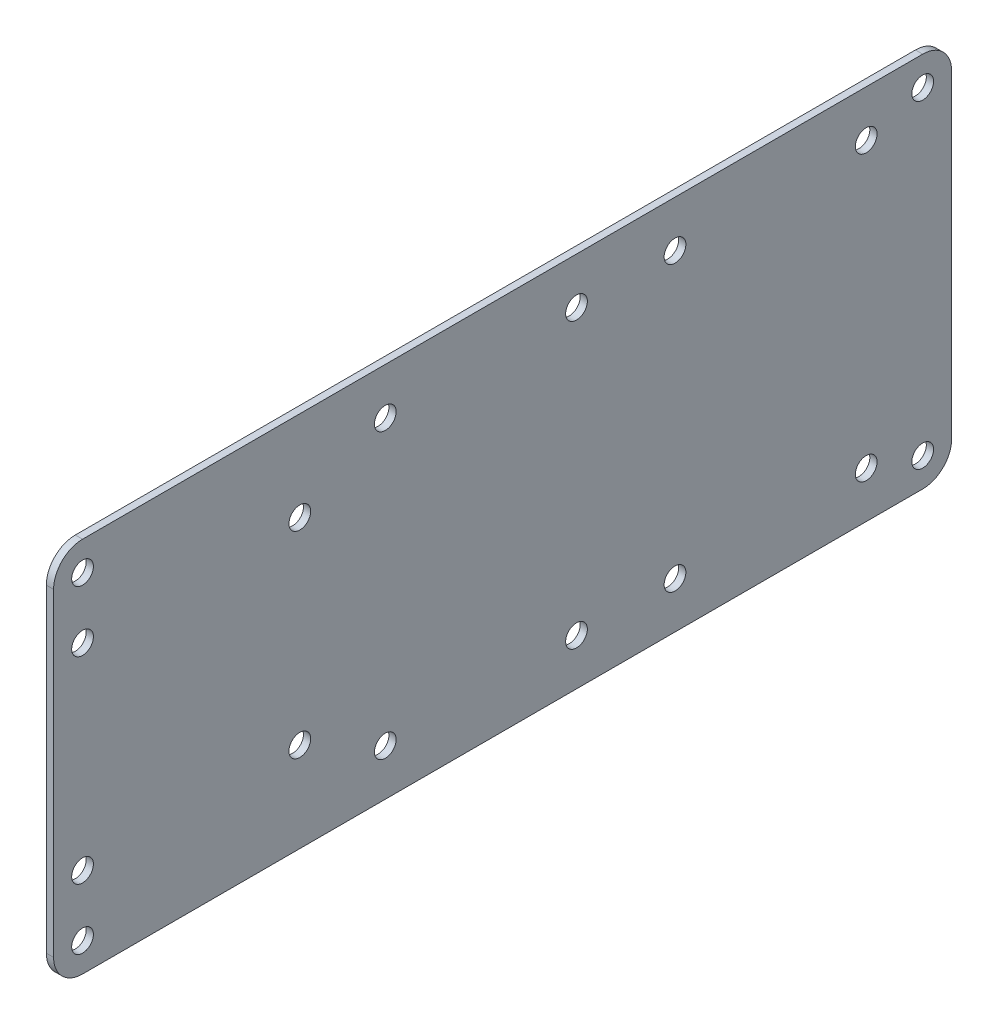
ISO-10303-21;
HEADER;
FILE_DESCRIPTION(('STEP AP214'),'2;1');
FILE_NAME('part.step','',(''),(''),'','','');
FILE_SCHEMA(('AUTOMOTIVE_DESIGN { 1 0 10303 214 1 1 1 1 }'));
ENDSEC;
DATA;
#1=APPLICATION_CONTEXT('core data for automotive mechanical design processes');
#2=APPLICATION_PROTOCOL_DEFINITION('international standard','automotive_design',2000,#1);
#3=PRODUCT_CONTEXT('',#1,'mechanical');
#4=PRODUCT('Part','Part','',(#3));
#5=PRODUCT_RELATED_PRODUCT_CATEGORY('part','',(#4));
#6=PRODUCT_DEFINITION_FORMATION('','',#4);
#7=PRODUCT_DEFINITION_CONTEXT('part definition',#1,'design');
#8=PRODUCT_DEFINITION('design','',#6,#7);
#9=PRODUCT_DEFINITION_SHAPE('','',#8);
#10=(LENGTH_UNIT() NAMED_UNIT(*) SI_UNIT(.MILLI.,.METRE.));
#11=(NAMED_UNIT(*) PLANE_ANGLE_UNIT() SI_UNIT($,.RADIAN.));
#12=(NAMED_UNIT(*) SI_UNIT($,.STERADIAN.) SOLID_ANGLE_UNIT());
#13=UNCERTAINTY_MEASURE_WITH_UNIT(LENGTH_MEASURE(1.E-05),#10,'distance_accuracy_value','');
#14=(GEOMETRIC_REPRESENTATION_CONTEXT(3) GLOBAL_UNCERTAINTY_ASSIGNED_CONTEXT((#13)) GLOBAL_UNIT_ASSIGNED_CONTEXT((#10,
#11,#12)) REPRESENTATION_CONTEXT('',''));
#15=CARTESIAN_POINT('',(0.,0.,0.));
#16=DIRECTION('',(0.,0.,1.));
#17=DIRECTION('',(1.,0.,0.));
#18=AXIS2_PLACEMENT_3D('',#15,#16,#17);
#19=CARTESIAN_POINT('',(1.5875,0.,0.));
#20=DIRECTION('',(1.,0.,0.));
#21=DIRECTION('',(0.,0.,-1.));
#22=AXIS2_PLACEMENT_3D('',#19,#20,#21);
#23=PLANE('',#22);
#24=CARTESIAN_POINT('',(1.5875,-72.39,-178.1175));
#25=DIRECTION('',(1.,0.,0.));
#26=DIRECTION('',(0.,0.,-1.));
#27=AXIS2_PLACEMENT_3D('',#24,#25,#26);
#28=CIRCLE('',#27,2.38125);
#29=CARTESIAN_POINT('',(1.5875,-72.39,-180.49875));
#30=VERTEX_POINT('',#29);
#31=EDGE_CURVE('E261',#30,#30,#28,.T.);
#32=ORIENTED_EDGE('',*,*,#31,.F.);
#33=EDGE_LOOP('',(#32));
#34=FACE_BOUND('',#33,.T.);
#35=CARTESIAN_POINT('',(1.5875,-10.16,-178.1175));
#36=DIRECTION('',(1.,0.,0.));
#37=DIRECTION('',(0.,0.,-1.));
#38=AXIS2_PLACEMENT_3D('',#35,#36,#37);
#39=CIRCLE('',#38,2.38125000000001);
#40=CARTESIAN_POINT('',(1.5875,-10.16,-180.49875));
#41=VERTEX_POINT('',#40);
#42=EDGE_CURVE('E255',#41,#41,#39,.T.);
#43=ORIENTED_EDGE('',*,*,#42,.F.);
#44=EDGE_LOOP('',(#43));
#45=FACE_BOUND('',#44,.T.);
#46=CARTESIAN_POINT('',(1.5875,-10.16,-136.2075));
#47=DIRECTION('',(1.,0.,0.));
#48=DIRECTION('',(0.,0.,-1.));
#49=AXIS2_PLACEMENT_3D('',#46,#47,#48);
#50=CIRCLE('',#49,2.38125000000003);
#51=CARTESIAN_POINT('',(1.5875,-10.16,-138.58875));
#52=VERTEX_POINT('',#51);
#53=EDGE_CURVE('E249',#52,#52,#50,.T.);
#54=ORIENTED_EDGE('',*,*,#53,.F.);
#55=EDGE_LOOP('',(#54));
#56=FACE_BOUND('',#55,.T.);
#57=CARTESIAN_POINT('',(1.5875,-72.39,-136.2075));
#58=DIRECTION('',(1.,0.,0.));
#59=DIRECTION('',(0.,0.,-1.));
#60=AXIS2_PLACEMENT_3D('',#57,#58,#59);
#61=CIRCLE('',#60,2.38125);
#62=CARTESIAN_POINT('',(1.5875,-72.39,-138.58875));
#63=VERTEX_POINT('',#62);
#64=EDGE_CURVE('E243',#63,#63,#61,.T.);
#65=ORIENTED_EDGE('',*,*,#64,.F.);
#66=EDGE_LOOP('',(#65));
#67=FACE_BOUND('',#66,.T.);
#68=CARTESIAN_POINT('',(1.5875,-72.39,-72.7075000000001));
#69=DIRECTION('',(1.,0.,0.));
#70=DIRECTION('',(0.,0.,-1.));
#71=AXIS2_PLACEMENT_3D('',#68,#69,#70);
#72=CIRCLE('',#71,2.38125);
#73=CARTESIAN_POINT('',(1.5875,-72.39,-75.08875));
#74=VERTEX_POINT('',#73);
#75=EDGE_CURVE('E237',#74,#74,#72,.T.);
#76=ORIENTED_EDGE('',*,*,#75,.F.);
#77=EDGE_LOOP('',(#76));
#78=FACE_BOUND('',#77,.T.);
#79=CARTESIAN_POINT('',(1.5875,-72.39,-114.6175));
#80=DIRECTION('',(1.,0.,0.));
#81=DIRECTION('',(0.,0.,-1.));
#82=AXIS2_PLACEMENT_3D('',#79,#80,#81);
#83=CIRCLE('',#82,2.38125);
#84=CARTESIAN_POINT('',(1.5875,-72.39,-116.99875));
#85=VERTEX_POINT('',#84);
#86=EDGE_CURVE('E231',#85,#85,#83,.T.);
#87=ORIENTED_EDGE('',*,*,#86,.F.);
#88=EDGE_LOOP('',(#87));
#89=FACE_BOUND('',#88,.T.);
#90=CARTESIAN_POINT('',(1.5875,-10.16,-114.6175));
#91=DIRECTION('',(1.,0.,0.));
#92=DIRECTION('',(0.,0.,-1.));
#93=AXIS2_PLACEMENT_3D('',#90,#91,#92);
#94=CIRCLE('',#93,2.38125000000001);
#95=CARTESIAN_POINT('',(1.5875,-10.16,-116.99875));
#96=VERTEX_POINT('',#95);
#97=EDGE_CURVE('E225',#96,#96,#94,.T.);
#98=ORIENTED_EDGE('',*,*,#97,.F.);
#99=EDGE_LOOP('',(#98));
#100=FACE_BOUND('',#99,.T.);
#101=CARTESIAN_POINT('',(1.5875,-10.16,-72.7075));
#102=DIRECTION('',(1.,0.,0.));
#103=DIRECTION('',(0.,0.,-1.));
#104=AXIS2_PLACEMENT_3D('',#101,#102,#103);
#105=CIRCLE('',#104,2.38125000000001);
#106=CARTESIAN_POINT('',(1.5875,-10.16,-75.08875));
#107=VERTEX_POINT('',#106);
#108=EDGE_CURVE('E219',#107,#107,#105,.T.);
#109=ORIENTED_EDGE('',*,*,#108,.F.);
#110=EDGE_LOOP('',(#109));
#111=FACE_BOUND('',#110,.T.);
#112=CARTESIAN_POINT('',(1.5875,-19.685,-53.975));
#113=DIRECTION('',(1.,0.,0.));
#114=DIRECTION('',(0.,0.,-1.));
#115=AXIS2_PLACEMENT_3D('',#112,#113,#114);
#116=CIRCLE('',#115,2.38125);
#117=CARTESIAN_POINT('',(1.5875,-19.685,-56.35625));
#118=VERTEX_POINT('',#117);
#119=EDGE_CURVE('E213',#118,#118,#116,.T.);
#120=ORIENTED_EDGE('',*,*,#119,.F.);
#121=EDGE_LOOP('',(#120));
#122=FACE_BOUND('',#121,.T.);
#123=CARTESIAN_POINT('',(1.5875,-62.865,-53.975));
#124=DIRECTION('',(1.,0.,0.));
#125=DIRECTION('',(0.,0.,-1.));
#126=AXIS2_PLACEMENT_3D('',#123,#124,#125);
#127=CIRCLE('',#126,2.38125);
#128=CARTESIAN_POINT('',(1.5875,-62.865,-56.35625));
#129=VERTEX_POINT('',#128);
#130=EDGE_CURVE('E207',#129,#129,#127,.T.);
#131=ORIENTED_EDGE('',*,*,#130,.F.);
#132=EDGE_LOOP('',(#131));
#133=FACE_BOUND('',#132,.T.);
#134=CARTESIAN_POINT('',(1.5875,-62.865,-6.35000000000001));
#135=DIRECTION('',(1.,0.,0.));
#136=DIRECTION('',(0.,0.,-1.));
#137=AXIS2_PLACEMENT_3D('',#134,#135,#136);
#138=CIRCLE('',#137,2.38125000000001);
#139=CARTESIAN_POINT('',(1.5875,-62.865,-8.73125000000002));
#140=VERTEX_POINT('',#139);
#141=EDGE_CURVE('E201',#140,#140,#138,.T.);
#142=ORIENTED_EDGE('',*,*,#141,.F.);
#143=EDGE_LOOP('',(#142));
#144=FACE_BOUND('',#143,.T.);
#145=CARTESIAN_POINT('',(1.5875,-19.685,-6.35));
#146=DIRECTION('',(1.,0.,0.));
#147=DIRECTION('',(0.,0.,-1.));
#148=AXIS2_PLACEMENT_3D('',#145,#146,#147);
#149=CIRCLE('',#148,2.38125);
#150=CARTESIAN_POINT('',(1.5875,-19.685,-8.73125000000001));
#151=VERTEX_POINT('',#150);
#152=EDGE_CURVE('E195',#151,#151,#149,.T.);
#153=ORIENTED_EDGE('',*,*,#152,.F.);
#154=EDGE_LOOP('',(#153));
#155=FACE_BOUND('',#154,.T.);
#156=CARTESIAN_POINT('',(1.5875,-76.2,-190.5));
#157=DIRECTION('',(1.,0.,0.));
#158=DIRECTION('',(0.,0.,-1.));
#159=AXIS2_PLACEMENT_3D('',#156,#157,#158);
#160=CIRCLE('',#159,2.38125);
#161=CARTESIAN_POINT('',(1.5875,-76.2,-192.88125));
#162=VERTEX_POINT('',#161);
#163=EDGE_CURVE('E180',#162,#162,#160,.T.);
#164=ORIENTED_EDGE('',*,*,#163,.F.);
#165=EDGE_LOOP('',(#164));
#166=FACE_BOUND('',#165,.T.);
#167=CARTESIAN_POINT('',(1.5875,-6.35,-6.35));
#168=DIRECTION('',(1.,0.,0.));
#169=DIRECTION('',(0.,0.,-1.));
#170=AXIS2_PLACEMENT_3D('',#167,#168,#169);
#171=CIRCLE('',#170,2.38125);
#172=CARTESIAN_POINT('',(1.5875,-6.35,-8.73125));
#173=VERTEX_POINT('',#172);
#174=EDGE_CURVE('E163',#173,#173,#171,.T.);
#175=ORIENTED_EDGE('',*,*,#174,.F.);
#176=EDGE_LOOP('',(#175));
#177=FACE_BOUND('',#176,.T.);
#178=DIRECTION('',(0.,1.,0.));
#179=VECTOR('',#178,1.);
#180=CARTESIAN_POINT('',(1.5875,0.,-196.85));
#181=LINE('',#180,#179);
#182=CARTESIAN_POINT('',(1.5875,-76.2,-196.85));
#183=VERTEX_POINT('',#182);
#184=CARTESIAN_POINT('',(1.5875,-6.35,-196.85));
#185=VERTEX_POINT('',#184);
#186=EDGE_CURVE('E170',#183,#185,#181,.T.);
#187=ORIENTED_EDGE('',*,*,#186,.T.);
#188=CARTESIAN_POINT('',(1.5875,-6.35,-190.5));
#189=DIRECTION('',(1.,0.,0.));
#190=DIRECTION('',(0.,0.,-1.));
#191=AXIS2_PLACEMENT_3D('',#188,#189,#190);
#192=CIRCLE('',#191,6.35);
#193=CARTESIAN_POINT('',(1.5875,0.,-190.5));
#194=VERTEX_POINT('',#193);
#195=EDGE_CURVE('E147',#185,#194,#192,.T.);
#196=ORIENTED_EDGE('',*,*,#195,.T.);
#197=DIRECTION('',(0.,0.,1.));
#198=VECTOR('',#197,1.);
#199=CARTESIAN_POINT('',(1.5875,0.,0.));
#200=LINE('',#199,#198);
#201=CARTESIAN_POINT('',(1.5875,0.,-6.35));
#202=VERTEX_POINT('',#201);
#203=EDGE_CURVE('E118',#194,#202,#200,.T.);
#204=ORIENTED_EDGE('',*,*,#203,.T.);
#205=CARTESIAN_POINT('',(1.5875,-6.35,-6.35));
#206=DIRECTION('',(1.,0.,0.));
#207=DIRECTION('',(0.,0.,-1.));
#208=AXIS2_PLACEMENT_3D('',#205,#206,#207);
#209=CIRCLE('',#208,6.35);
#210=CARTESIAN_POINT('',(1.5875,-6.35,0.));
#211=VERTEX_POINT('',#210);
#212=EDGE_CURVE('E142',#202,#211,#209,.T.);
#213=ORIENTED_EDGE('',*,*,#212,.T.);
#214=DIRECTION('',(0.,-1.,0.));
#215=VECTOR('',#214,1.);
#216=CARTESIAN_POINT('',(1.5875,0.,0.));
#217=LINE('',#216,#215);
#218=CARTESIAN_POINT('',(1.5875,-76.2,0.));
#219=VERTEX_POINT('',#218);
#220=EDGE_CURVE('E125',#211,#219,#217,.T.);
#221=ORIENTED_EDGE('',*,*,#220,.T.);
#222=CARTESIAN_POINT('',(1.5875,-76.2,-6.35000000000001));
#223=DIRECTION('',(1.,0.,0.));
#224=DIRECTION('',(0.,0.,-1.));
#225=AXIS2_PLACEMENT_3D('',#222,#223,#224);
#226=CIRCLE('',#225,6.35);
#227=CARTESIAN_POINT('',(1.5875,-82.55,-6.35000000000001));
#228=VERTEX_POINT('',#227);
#229=EDGE_CURVE('E54',#219,#228,#226,.T.);
#230=ORIENTED_EDGE('',*,*,#229,.T.);
#231=DIRECTION('',(0.,0.,-1.));
#232=VECTOR('',#231,1.);
#233=CARTESIAN_POINT('',(1.5875,-82.55,0.));
#234=LINE('',#233,#232);
#235=CARTESIAN_POINT('',(1.5875,-82.55,-190.5));
#236=VERTEX_POINT('',#235);
#237=EDGE_CURVE('E128',#228,#236,#234,.T.);
#238=ORIENTED_EDGE('',*,*,#237,.T.);
#239=CARTESIAN_POINT('',(1.5875,-76.2,-190.5));
#240=DIRECTION('',(1.,0.,0.));
#241=DIRECTION('',(0.,0.,-1.));
#242=AXIS2_PLACEMENT_3D('',#239,#240,#241);
#243=CIRCLE('',#242,6.35);
#244=EDGE_CURVE('E145',#236,#183,#243,.T.);
#245=ORIENTED_EDGE('',*,*,#244,.T.);
#246=EDGE_LOOP('',(#187,#196,#204,#213,#221,#230,#238,#245));
#247=FACE_BOUND('',#246,.T.);
#248=CARTESIAN_POINT('',(1.5875,-76.2,-6.35000000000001));
#249=DIRECTION('',(1.,0.,0.));
#250=DIRECTION('',(0.,0.,-1.));
#251=AXIS2_PLACEMENT_3D('',#248,#249,#250);
#252=CIRCLE('',#251,2.38125);
#253=CARTESIAN_POINT('',(1.5875,-76.2,-8.73125000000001));
#254=VERTEX_POINT('',#253);
#255=EDGE_CURVE('E175',#254,#254,#252,.T.);
#256=ORIENTED_EDGE('',*,*,#255,.F.);
#257=EDGE_LOOP('',(#256));
#258=FACE_BOUND('',#257,.T.);
#259=CARTESIAN_POINT('',(1.5875,-6.35,-190.5));
#260=DIRECTION('',(1.,0.,0.));
#261=DIRECTION('',(0.,0.,-1.));
#262=AXIS2_PLACEMENT_3D('',#259,#260,#261);
#263=CIRCLE('',#262,2.38125000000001);
#264=CARTESIAN_POINT('',(1.5875,-6.35,-192.88125));
#265=VERTEX_POINT('',#264);
#266=EDGE_CURVE('E186',#265,#265,#263,.T.);
#267=ORIENTED_EDGE('',*,*,#266,.F.);
#268=EDGE_LOOP('',(#267));
#269=FACE_BOUND('',#268,.T.);
#270=ADVANCED_FACE('F32',(#34,#45,#56,#67,#78,#89,#100,#111,#122,#133,#144,#155,#166,#177,#247,
#258,#269),#23,.T.);
#271=CARTESIAN_POINT('',(0.,0.,0.));
#272=DIRECTION('',(1.,0.,0.));
#273=DIRECTION('',(0.,0.,-1.));
#274=AXIS2_PLACEMENT_3D('',#271,#272,#273);
#275=PLANE('',#274);
#276=CARTESIAN_POINT('',(0.,-72.39,-178.1175));
#277=DIRECTION('',(1.,0.,0.));
#278=DIRECTION('',(0.,0.,-1.));
#279=AXIS2_PLACEMENT_3D('',#276,#277,#278);
#280=CIRCLE('',#279,2.38125);
#281=CARTESIAN_POINT('',(0.,-72.39,-180.49875));
#282=VERTEX_POINT('',#281);
#283=EDGE_CURVE('E258',#282,#282,#280,.T.);
#284=ORIENTED_EDGE('',*,*,#283,.T.);
#285=EDGE_LOOP('',(#284));
#286=FACE_BOUND('',#285,.T.);
#287=CARTESIAN_POINT('',(0.,-10.16,-178.1175));
#288=DIRECTION('',(1.,0.,0.));
#289=DIRECTION('',(0.,0.,-1.));
#290=AXIS2_PLACEMENT_3D('',#287,#288,#289);
#291=CIRCLE('',#290,2.38125000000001);
#292=CARTESIAN_POINT('',(0.,-10.16,-180.49875));
#293=VERTEX_POINT('',#292);
#294=EDGE_CURVE('E252',#293,#293,#291,.T.);
#295=ORIENTED_EDGE('',*,*,#294,.T.);
#296=EDGE_LOOP('',(#295));
#297=FACE_BOUND('',#296,.T.);
#298=CARTESIAN_POINT('',(0.,-10.16,-136.2075));
#299=DIRECTION('',(1.,0.,0.));
#300=DIRECTION('',(0.,0.,-1.));
#301=AXIS2_PLACEMENT_3D('',#298,#299,#300);
#302=CIRCLE('',#301,2.38125000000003);
#303=CARTESIAN_POINT('',(0.,-10.16,-138.58875));
#304=VERTEX_POINT('',#303);
#305=EDGE_CURVE('E246',#304,#304,#302,.T.);
#306=ORIENTED_EDGE('',*,*,#305,.T.);
#307=EDGE_LOOP('',(#306));
#308=FACE_BOUND('',#307,.T.);
#309=CARTESIAN_POINT('',(0.,-72.39,-136.2075));
#310=DIRECTION('',(1.,0.,0.));
#311=DIRECTION('',(0.,0.,-1.));
#312=AXIS2_PLACEMENT_3D('',#309,#310,#311);
#313=CIRCLE('',#312,2.38125);
#314=CARTESIAN_POINT('',(0.,-72.39,-138.58875));
#315=VERTEX_POINT('',#314);
#316=EDGE_CURVE('E240',#315,#315,#313,.T.);
#317=ORIENTED_EDGE('',*,*,#316,.T.);
#318=EDGE_LOOP('',(#317));
#319=FACE_BOUND('',#318,.T.);
#320=CARTESIAN_POINT('',(0.,-72.39,-72.7075000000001));
#321=DIRECTION('',(1.,0.,0.));
#322=DIRECTION('',(0.,0.,-1.));
#323=AXIS2_PLACEMENT_3D('',#320,#321,#322);
#324=CIRCLE('',#323,2.38125);
#325=CARTESIAN_POINT('',(0.,-72.39,-75.08875));
#326=VERTEX_POINT('',#325);
#327=EDGE_CURVE('E234',#326,#326,#324,.T.);
#328=ORIENTED_EDGE('',*,*,#327,.T.);
#329=EDGE_LOOP('',(#328));
#330=FACE_BOUND('',#329,.T.);
#331=CARTESIAN_POINT('',(0.,-72.39,-114.6175));
#332=DIRECTION('',(1.,0.,0.));
#333=DIRECTION('',(0.,0.,-1.));
#334=AXIS2_PLACEMENT_3D('',#331,#332,#333);
#335=CIRCLE('',#334,2.38125);
#336=CARTESIAN_POINT('',(0.,-72.39,-116.99875));
#337=VERTEX_POINT('',#336);
#338=EDGE_CURVE('E228',#337,#337,#335,.T.);
#339=ORIENTED_EDGE('',*,*,#338,.T.);
#340=EDGE_LOOP('',(#339));
#341=FACE_BOUND('',#340,.T.);
#342=CARTESIAN_POINT('',(0.,-10.16,-114.6175));
#343=DIRECTION('',(1.,0.,0.));
#344=DIRECTION('',(0.,0.,-1.));
#345=AXIS2_PLACEMENT_3D('',#342,#343,#344);
#346=CIRCLE('',#345,2.38125000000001);
#347=CARTESIAN_POINT('',(0.,-10.16,-116.99875));
#348=VERTEX_POINT('',#347);
#349=EDGE_CURVE('E222',#348,#348,#346,.T.);
#350=ORIENTED_EDGE('',*,*,#349,.T.);
#351=EDGE_LOOP('',(#350));
#352=FACE_BOUND('',#351,.T.);
#353=CARTESIAN_POINT('',(0.,-10.16,-72.7075));
#354=DIRECTION('',(1.,0.,0.));
#355=DIRECTION('',(0.,0.,-1.));
#356=AXIS2_PLACEMENT_3D('',#353,#354,#355);
#357=CIRCLE('',#356,2.38125000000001);
#358=CARTESIAN_POINT('',(0.,-10.16,-75.08875));
#359=VERTEX_POINT('',#358);
#360=EDGE_CURVE('E216',#359,#359,#357,.T.);
#361=ORIENTED_EDGE('',*,*,#360,.T.);
#362=EDGE_LOOP('',(#361));
#363=FACE_BOUND('',#362,.T.);
#364=CARTESIAN_POINT('',(0.,-19.685,-53.975));
#365=DIRECTION('',(1.,0.,0.));
#366=DIRECTION('',(0.,0.,-1.));
#367=AXIS2_PLACEMENT_3D('',#364,#365,#366);
#368=CIRCLE('',#367,2.38125);
#369=CARTESIAN_POINT('',(0.,-19.685,-56.35625));
#370=VERTEX_POINT('',#369);
#371=EDGE_CURVE('E210',#370,#370,#368,.T.);
#372=ORIENTED_EDGE('',*,*,#371,.T.);
#373=EDGE_LOOP('',(#372));
#374=FACE_BOUND('',#373,.T.);
#375=CARTESIAN_POINT('',(0.,-62.865,-53.975));
#376=DIRECTION('',(1.,0.,0.));
#377=DIRECTION('',(0.,0.,-1.));
#378=AXIS2_PLACEMENT_3D('',#375,#376,#377);
#379=CIRCLE('',#378,2.38125);
#380=CARTESIAN_POINT('',(0.,-62.865,-56.35625));
#381=VERTEX_POINT('',#380);
#382=EDGE_CURVE('E204',#381,#381,#379,.T.);
#383=ORIENTED_EDGE('',*,*,#382,.T.);
#384=EDGE_LOOP('',(#383));
#385=FACE_BOUND('',#384,.T.);
#386=CARTESIAN_POINT('',(0.,-62.865,-6.35000000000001));
#387=DIRECTION('',(1.,0.,0.));
#388=DIRECTION('',(0.,0.,-1.));
#389=AXIS2_PLACEMENT_3D('',#386,#387,#388);
#390=CIRCLE('',#389,2.38125000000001);
#391=CARTESIAN_POINT('',(0.,-62.865,-8.73125000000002));
#392=VERTEX_POINT('',#391);
#393=EDGE_CURVE('E198',#392,#392,#390,.T.);
#394=ORIENTED_EDGE('',*,*,#393,.T.);
#395=EDGE_LOOP('',(#394));
#396=FACE_BOUND('',#395,.T.);
#397=CARTESIAN_POINT('',(0.,-19.685,-6.35));
#398=DIRECTION('',(1.,0.,0.));
#399=DIRECTION('',(0.,0.,-1.));
#400=AXIS2_PLACEMENT_3D('',#397,#398,#399);
#401=CIRCLE('',#400,2.38125);
#402=CARTESIAN_POINT('',(0.,-19.685,-8.73125000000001));
#403=VERTEX_POINT('',#402);
#404=EDGE_CURVE('E192',#403,#403,#401,.T.);
#405=ORIENTED_EDGE('',*,*,#404,.T.);
#406=EDGE_LOOP('',(#405));
#407=FACE_BOUND('',#406,.T.);
#408=DIRECTION('',(0.,0.,1.));
#409=VECTOR('',#408,1.);
#410=CARTESIAN_POINT('',(0.,0.,0.));
#411=LINE('',#410,#409);
#412=CARTESIAN_POINT('',(0.,0.,-190.5));
#413=VERTEX_POINT('',#412);
#414=CARTESIAN_POINT('',(0.,0.,-6.35));
#415=VERTEX_POINT('',#414);
#416=EDGE_CURVE('E115',#413,#415,#411,.T.);
#417=ORIENTED_EDGE('',*,*,#416,.F.);
#418=CARTESIAN_POINT('',(0.,-6.35,-190.5));
#419=DIRECTION('',(1.,0.,0.));
#420=DIRECTION('',(0.,0.,-1.));
#421=AXIS2_PLACEMENT_3D('',#418,#419,#420);
#422=CIRCLE('',#421,6.35);
#423=CARTESIAN_POINT('',(0.,-6.35,-196.85));
#424=VERTEX_POINT('',#423);
#425=EDGE_CURVE('E98',#413,#424,#422,.F.);
#426=ORIENTED_EDGE('',*,*,#425,.T.);
#427=DIRECTION('',(0.,1.,0.));
#428=VECTOR('',#427,1.);
#429=CARTESIAN_POINT('',(0.,0.,-196.85));
#430=LINE('',#429,#428);
#431=CARTESIAN_POINT('',(0.,-76.2,-196.85));
#432=VERTEX_POINT('',#431);
#433=EDGE_CURVE('E126',#432,#424,#430,.T.);
#434=ORIENTED_EDGE('',*,*,#433,.F.);
#435=CARTESIAN_POINT('',(0.,-76.2,-190.5));
#436=DIRECTION('',(1.,0.,0.));
#437=DIRECTION('',(0.,0.,-1.));
#438=AXIS2_PLACEMENT_3D('',#435,#436,#437);
#439=CIRCLE('',#438,6.35);
#440=CARTESIAN_POINT('',(0.,-82.55,-190.5));
#441=VERTEX_POINT('',#440);
#442=EDGE_CURVE('E109',#432,#441,#439,.F.);
#443=ORIENTED_EDGE('',*,*,#442,.T.);
#444=DIRECTION('',(0.,0.,-1.));
#445=VECTOR('',#444,1.);
#446=CARTESIAN_POINT('',(0.,-82.55,0.));
#447=LINE('',#446,#445);
#448=CARTESIAN_POINT('',(0.,-82.55,-6.35000000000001));
#449=VERTEX_POINT('',#448);
#450=EDGE_CURVE('E130',#449,#441,#447,.T.);
#451=ORIENTED_EDGE('',*,*,#450,.F.);
#452=CARTESIAN_POINT('',(0.,-76.2,-6.35000000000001));
#453=DIRECTION('',(1.,0.,0.));
#454=DIRECTION('',(0.,0.,-1.));
#455=AXIS2_PLACEMENT_3D('',#452,#453,#454);
#456=CIRCLE('',#455,6.35);
#457=CARTESIAN_POINT('',(0.,-76.2,0.));
#458=VERTEX_POINT('',#457);
#459=EDGE_CURVE('E136',#449,#458,#456,.F.);
#460=ORIENTED_EDGE('',*,*,#459,.T.);
#461=DIRECTION('',(0.,-1.,0.));
#462=VECTOR('',#461,1.);
#463=CARTESIAN_POINT('',(0.,0.,0.));
#464=LINE('',#463,#462);
#465=CARTESIAN_POINT('',(0.,-6.35,0.));
#466=VERTEX_POINT('',#465);
#467=EDGE_CURVE('E158',#466,#458,#464,.T.);
#468=ORIENTED_EDGE('',*,*,#467,.F.);
#469=CARTESIAN_POINT('',(0.,-6.35,-6.35));
#470=DIRECTION('',(1.,0.,0.));
#471=DIRECTION('',(0.,0.,-1.));
#472=AXIS2_PLACEMENT_3D('',#469,#470,#471);
#473=CIRCLE('',#472,6.35);
#474=EDGE_CURVE('E119',#466,#415,#473,.F.);
#475=ORIENTED_EDGE('',*,*,#474,.T.);
#476=EDGE_LOOP('',(#417,#426,#434,#443,#451,#460,#468,#475));
#477=FACE_BOUND('',#476,.T.);
#478=CARTESIAN_POINT('',(0.,-6.35,-6.35));
#479=DIRECTION('',(1.,0.,0.));
#480=DIRECTION('',(0.,0.,-1.));
#481=AXIS2_PLACEMENT_3D('',#478,#479,#480);
#482=CIRCLE('',#481,2.38125);
#483=CARTESIAN_POINT('',(0.,-6.35,-8.73125));
#484=VERTEX_POINT('',#483);
#485=EDGE_CURVE('E166',#484,#484,#482,.T.);
#486=ORIENTED_EDGE('',*,*,#485,.T.);
#487=EDGE_LOOP('',(#486));
#488=FACE_BOUND('',#487,.T.);
#489=CARTESIAN_POINT('',(0.,-76.2,-6.35000000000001));
#490=DIRECTION('',(1.,0.,0.));
#491=DIRECTION('',(0.,0.,-1.));
#492=AXIS2_PLACEMENT_3D('',#489,#490,#491);
#493=CIRCLE('',#492,2.38125);
#494=CARTESIAN_POINT('',(0.,-76.2,-8.73125000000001));
#495=VERTEX_POINT('',#494);
#496=EDGE_CURVE('E177',#495,#495,#493,.T.);
#497=ORIENTED_EDGE('',*,*,#496,.T.);
#498=EDGE_LOOP('',(#497));
#499=FACE_BOUND('',#498,.T.);
#500=CARTESIAN_POINT('',(0.,-76.2,-190.5));
#501=DIRECTION('',(1.,0.,0.));
#502=DIRECTION('',(0.,0.,-1.));
#503=AXIS2_PLACEMENT_3D('',#500,#501,#502);
#504=CIRCLE('',#503,2.38125);
#505=CARTESIAN_POINT('',(0.,-76.2,-192.88125));
#506=VERTEX_POINT('',#505);
#507=EDGE_CURVE('E183',#506,#506,#504,.T.);
#508=ORIENTED_EDGE('',*,*,#507,.T.);
#509=EDGE_LOOP('',(#508));
#510=FACE_BOUND('',#509,.T.);
#511=CARTESIAN_POINT('',(0.,-6.35,-190.5));
#512=DIRECTION('',(1.,0.,0.));
#513=DIRECTION('',(0.,0.,-1.));
#514=AXIS2_PLACEMENT_3D('',#511,#512,#513);
#515=CIRCLE('',#514,2.38125000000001);
#516=CARTESIAN_POINT('',(0.,-6.35,-192.88125));
#517=VERTEX_POINT('',#516);
#518=EDGE_CURVE('E189',#517,#517,#515,.T.);
#519=ORIENTED_EDGE('',*,*,#518,.T.);
#520=EDGE_LOOP('',(#519));
#521=FACE_BOUND('',#520,.T.);
#522=ADVANCED_FACE('F122',(#286,#297,#308,#319,#330,#341,#352,#363,#374,#385,#396,#407,#477,
#488,#499,#510,#521),#275,.F.);
#523=CARTESIAN_POINT('',(1.5875,0.,0.));
#524=DIRECTION('',(0.,0.,-1.));
#525=DIRECTION('',(0.,1.,0.));
#526=AXIS2_PLACEMENT_3D('',#523,#524,#525);
#527=PLANE('',#526);
#528=ORIENTED_EDGE('',*,*,#467,.T.);
#529=DIRECTION('',(-1.,0.,0.));
#530=VECTOR('',#529,1.);
#531=CARTESIAN_POINT('',(1.5875,-76.2,0.));
#532=LINE('',#531,#530);
#533=EDGE_CURVE('E11',#458,#219,#532,.F.);
#534=ORIENTED_EDGE('',*,*,#533,.T.);
#535=ORIENTED_EDGE('',*,*,#220,.F.);
#536=DIRECTION('',(-1.,0.,0.));
#537=VECTOR('',#536,1.);
#538=CARTESIAN_POINT('',(1.5875,-6.35,0.));
#539=LINE('',#538,#537);
#540=EDGE_CURVE('E40',#211,#466,#539,.T.);
#541=ORIENTED_EDGE('',*,*,#540,.T.);
#542=EDGE_LOOP('',(#528,#534,#535,#541));
#543=FACE_BOUND('',#542,.T.);
#544=ADVANCED_FACE('F157',(#543),#527,.F.);
#545=CARTESIAN_POINT('',(1.5875,-82.55,0.));
#546=DIRECTION('',(0.,1.,0.));
#547=DIRECTION('',(0.,0.,1.));
#548=AXIS2_PLACEMENT_3D('',#545,#546,#547);
#549=PLANE('',#548);
#550=ORIENTED_EDGE('',*,*,#450,.T.);
#551=DIRECTION('',(-1.,0.,0.));
#552=VECTOR('',#551,1.);
#553=CARTESIAN_POINT('',(1.5875,-82.55,-190.5));
#554=LINE('',#553,#552);
#555=EDGE_CURVE('E47',#441,#236,#554,.F.);
#556=ORIENTED_EDGE('',*,*,#555,.T.);
#557=ORIENTED_EDGE('',*,*,#237,.F.);
#558=DIRECTION('',(-1.,0.,0.));
#559=VECTOR('',#558,1.);
#560=CARTESIAN_POINT('',(1.5875,-82.55,-6.35000000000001));
#561=LINE('',#560,#559);
#562=EDGE_CURVE('E149',#228,#449,#561,.T.);
#563=ORIENTED_EDGE('',*,*,#562,.T.);
#564=EDGE_LOOP('',(#550,#556,#557,#563));
#565=FACE_BOUND('',#564,.T.);
#566=ADVANCED_FACE('F323',(#565),#549,.F.);
#567=CARTESIAN_POINT('',(1.5875,0.,-196.85));
#568=DIRECTION('',(0.,0.,1.));
#569=DIRECTION('',(1.,0.,0.));
#570=AXIS2_PLACEMENT_3D('',#567,#568,#569);
#571=PLANE('',#570);
#572=ORIENTED_EDGE('',*,*,#433,.T.);
#573=DIRECTION('',(-1.,0.,0.));
#574=VECTOR('',#573,1.);
#575=CARTESIAN_POINT('',(1.5875,-6.35,-196.85));
#576=LINE('',#575,#574);
#577=EDGE_CURVE('E103',#424,#185,#576,.F.);
#578=ORIENTED_EDGE('',*,*,#577,.T.);
#579=ORIENTED_EDGE('',*,*,#186,.F.);
#580=DIRECTION('',(-1.,0.,0.));
#581=VECTOR('',#580,1.);
#582=CARTESIAN_POINT('',(1.5875,-76.2,-196.85));
#583=LINE('',#582,#581);
#584=EDGE_CURVE('E108',#183,#432,#583,.T.);
#585=ORIENTED_EDGE('',*,*,#584,.T.);
#586=EDGE_LOOP('',(#572,#578,#579,#585));
#587=FACE_BOUND('',#586,.T.);
#588=ADVANCED_FACE('F330',(#587),#571,.F.);
#589=CARTESIAN_POINT('',(1.5875,0.,0.));
#590=DIRECTION('',(0.,-1.,0.));
#591=DIRECTION('',(0.,0.,-1.));
#592=AXIS2_PLACEMENT_3D('',#589,#590,#591);
#593=PLANE('',#592);
#594=ORIENTED_EDGE('',*,*,#203,.F.);
#595=DIRECTION('',(-1.,0.,0.));
#596=VECTOR('',#595,1.);
#597=CARTESIAN_POINT('',(1.5875,0.,-190.5));
#598=LINE('',#597,#596);
#599=EDGE_CURVE('E102',#194,#413,#598,.T.);
#600=ORIENTED_EDGE('',*,*,#599,.T.);
#601=ORIENTED_EDGE('',*,*,#416,.T.);
#602=DIRECTION('',(-1.,0.,0.));
#603=VECTOR('',#602,1.);
#604=CARTESIAN_POINT('',(1.5875,0.,-6.35));
#605=LINE('',#604,#603);
#606=EDGE_CURVE('E120',#415,#202,#605,.F.);
#607=ORIENTED_EDGE('',*,*,#606,.T.);
#608=EDGE_LOOP('',(#594,#600,#601,#607));
#609=FACE_BOUND('',#608,.T.);
#610=ADVANCED_FACE('F114',(#609),#593,.F.);
#611=CARTESIAN_POINT('',(1.5875,-6.35,-6.35));
#612=DIRECTION('',(-1.,0.,0.));
#613=DIRECTION('',(0.,0.,1.));
#614=AXIS2_PLACEMENT_3D('',#611,#612,#613);
#615=CYLINDRICAL_SURFACE('',#614,2.38125);
#616=ORIENTED_EDGE('',*,*,#174,.T.);
#617=EDGE_LOOP('',(#616));
#618=FACE_BOUND('',#617,.T.);
#619=ORIENTED_EDGE('',*,*,#485,.F.);
#620=EDGE_LOOP('',(#619));
#621=FACE_BOUND('',#620,.T.);
#622=ADVANCED_FACE('F329',(#618,#621),#615,.F.);
#623=CARTESIAN_POINT('',(1.5875,-76.2,-6.35000000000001));
#624=DIRECTION('',(-1.,0.,0.));
#625=DIRECTION('',(0.,0.,1.));
#626=AXIS2_PLACEMENT_3D('',#623,#624,#625);
#627=CYLINDRICAL_SURFACE('',#626,2.38125);
#628=ORIENTED_EDGE('',*,*,#255,.T.);
#629=EDGE_LOOP('',(#628));
#630=FACE_BOUND('',#629,.T.);
#631=ORIENTED_EDGE('',*,*,#496,.F.);
#632=EDGE_LOOP('',(#631));
#633=FACE_BOUND('',#632,.T.);
#634=ADVANCED_FACE('F533',(#630,#633),#627,.F.);
#635=CARTESIAN_POINT('',(1.5875,-76.2,-190.5));
#636=DIRECTION('',(-1.,0.,0.));
#637=DIRECTION('',(0.,0.,1.));
#638=AXIS2_PLACEMENT_3D('',#635,#636,#637);
#639=CYLINDRICAL_SURFACE('',#638,2.38125);
#640=ORIENTED_EDGE('',*,*,#163,.T.);
#641=EDGE_LOOP('',(#640));
#642=FACE_BOUND('',#641,.T.);
#643=ORIENTED_EDGE('',*,*,#507,.F.);
#644=EDGE_LOOP('',(#643));
#645=FACE_BOUND('',#644,.T.);
#646=ADVANCED_FACE('F314',(#642,#645),#639,.F.);
#647=CARTESIAN_POINT('',(1.5875,-6.35,-190.5));
#648=DIRECTION('',(-1.,0.,0.));
#649=DIRECTION('',(0.,0.,1.));
#650=AXIS2_PLACEMENT_3D('',#647,#648,#649);
#651=CYLINDRICAL_SURFACE('',#650,2.38125000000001);
#652=ORIENTED_EDGE('',*,*,#266,.T.);
#653=EDGE_LOOP('',(#652));
#654=FACE_BOUND('',#653,.T.);
#655=ORIENTED_EDGE('',*,*,#518,.F.);
#656=EDGE_LOOP('',(#655));
#657=FACE_BOUND('',#656,.T.);
#658=ADVANCED_FACE('F310',(#654,#657),#651,.F.);
#659=CARTESIAN_POINT('',(0.,-19.685,-6.35));
#660=DIRECTION('',(1.,0.,0.));
#661=DIRECTION('',(0.,0.,-1.));
#662=AXIS2_PLACEMENT_3D('',#659,#660,#661);
#663=CYLINDRICAL_SURFACE('',#662,2.38125);
#664=ORIENTED_EDGE('',*,*,#404,.F.);
#665=EDGE_LOOP('',(#664));
#666=FACE_BOUND('',#665,.T.);
#667=ORIENTED_EDGE('',*,*,#152,.T.);
#668=EDGE_LOOP('',(#667));
#669=FACE_BOUND('',#668,.T.);
#670=ADVANCED_FACE('F313',(#666,#669),#663,.F.);
#671=CARTESIAN_POINT('',(0.,-62.865,-6.35000000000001));
#672=DIRECTION('',(1.,0.,0.));
#673=DIRECTION('',(0.,0.,-1.));
#674=AXIS2_PLACEMENT_3D('',#671,#672,#673);
#675=CYLINDRICAL_SURFACE('',#674,2.38125000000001);
#676=ORIENTED_EDGE('',*,*,#393,.F.);
#677=EDGE_LOOP('',(#676));
#678=FACE_BOUND('',#677,.T.);
#679=ORIENTED_EDGE('',*,*,#141,.T.);
#680=EDGE_LOOP('',(#679));
#681=FACE_BOUND('',#680,.T.);
#682=ADVANCED_FACE('F499',(#678,#681),#675,.F.);
#683=CARTESIAN_POINT('',(0.,-62.865,-53.975));
#684=DIRECTION('',(1.,0.,0.));
#685=DIRECTION('',(0.,0.,-1.));
#686=AXIS2_PLACEMENT_3D('',#683,#684,#685);
#687=CYLINDRICAL_SURFACE('',#686,2.38125);
#688=ORIENTED_EDGE('',*,*,#382,.F.);
#689=EDGE_LOOP('',(#688));
#690=FACE_BOUND('',#689,.T.);
#691=ORIENTED_EDGE('',*,*,#130,.T.);
#692=EDGE_LOOP('',(#691));
#693=FACE_BOUND('',#692,.T.);
#694=ADVANCED_FACE('F489',(#690,#693),#687,.F.);
#695=CARTESIAN_POINT('',(0.,-19.685,-53.975));
#696=DIRECTION('',(1.,0.,0.));
#697=DIRECTION('',(0.,0.,-1.));
#698=AXIS2_PLACEMENT_3D('',#695,#696,#697);
#699=CYLINDRICAL_SURFACE('',#698,2.38125);
#700=ORIENTED_EDGE('',*,*,#371,.F.);
#701=EDGE_LOOP('',(#700));
#702=FACE_BOUND('',#701,.T.);
#703=ORIENTED_EDGE('',*,*,#119,.T.);
#704=EDGE_LOOP('',(#703));
#705=FACE_BOUND('',#704,.T.);
#706=ADVANCED_FACE('F479',(#702,#705),#699,.F.);
#707=CARTESIAN_POINT('',(0.,-10.16,-72.7075));
#708=DIRECTION('',(1.,0.,0.));
#709=DIRECTION('',(0.,0.,-1.));
#710=AXIS2_PLACEMENT_3D('',#707,#708,#709);
#711=CYLINDRICAL_SURFACE('',#710,2.38125000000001);
#712=ORIENTED_EDGE('',*,*,#360,.F.);
#713=EDGE_LOOP('',(#712));
#714=FACE_BOUND('',#713,.T.);
#715=ORIENTED_EDGE('',*,*,#108,.T.);
#716=EDGE_LOOP('',(#715));
#717=FACE_BOUND('',#716,.T.);
#718=ADVANCED_FACE('F469',(#714,#717),#711,.F.);
#719=CARTESIAN_POINT('',(0.,-10.16,-114.6175));
#720=DIRECTION('',(1.,0.,0.));
#721=DIRECTION('',(0.,0.,-1.));
#722=AXIS2_PLACEMENT_3D('',#719,#720,#721);
#723=CYLINDRICAL_SURFACE('',#722,2.38125000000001);
#724=ORIENTED_EDGE('',*,*,#349,.F.);
#725=EDGE_LOOP('',(#724));
#726=FACE_BOUND('',#725,.T.);
#727=ORIENTED_EDGE('',*,*,#97,.T.);
#728=EDGE_LOOP('',(#727));
#729=FACE_BOUND('',#728,.T.);
#730=ADVANCED_FACE('F459',(#726,#729),#723,.F.);
#731=CARTESIAN_POINT('',(0.,-72.39,-114.6175));
#732=DIRECTION('',(1.,0.,0.));
#733=DIRECTION('',(0.,0.,-1.));
#734=AXIS2_PLACEMENT_3D('',#731,#732,#733);
#735=CYLINDRICAL_SURFACE('',#734,2.38125);
#736=ORIENTED_EDGE('',*,*,#338,.F.);
#737=EDGE_LOOP('',(#736));
#738=FACE_BOUND('',#737,.T.);
#739=ORIENTED_EDGE('',*,*,#86,.T.);
#740=EDGE_LOOP('',(#739));
#741=FACE_BOUND('',#740,.T.);
#742=ADVANCED_FACE('F449',(#738,#741),#735,.F.);
#743=CARTESIAN_POINT('',(0.,-72.39,-72.7075000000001));
#744=DIRECTION('',(1.,0.,0.));
#745=DIRECTION('',(0.,0.,-1.));
#746=AXIS2_PLACEMENT_3D('',#743,#744,#745);
#747=CYLINDRICAL_SURFACE('',#746,2.38125);
#748=ORIENTED_EDGE('',*,*,#327,.F.);
#749=EDGE_LOOP('',(#748));
#750=FACE_BOUND('',#749,.T.);
#751=ORIENTED_EDGE('',*,*,#75,.T.);
#752=EDGE_LOOP('',(#751));
#753=FACE_BOUND('',#752,.T.);
#754=ADVANCED_FACE('F439',(#750,#753),#747,.F.);
#755=CARTESIAN_POINT('',(0.,-72.39,-136.2075));
#756=DIRECTION('',(1.,0.,0.));
#757=DIRECTION('',(0.,0.,-1.));
#758=AXIS2_PLACEMENT_3D('',#755,#756,#757);
#759=CYLINDRICAL_SURFACE('',#758,2.38125);
#760=ORIENTED_EDGE('',*,*,#316,.F.);
#761=EDGE_LOOP('',(#760));
#762=FACE_BOUND('',#761,.T.);
#763=ORIENTED_EDGE('',*,*,#64,.T.);
#764=EDGE_LOOP('',(#763));
#765=FACE_BOUND('',#764,.T.);
#766=ADVANCED_FACE('F429',(#762,#765),#759,.F.);
#767=CARTESIAN_POINT('',(0.,-10.16,-136.2075));
#768=DIRECTION('',(1.,0.,0.));
#769=DIRECTION('',(0.,0.,-1.));
#770=AXIS2_PLACEMENT_3D('',#767,#768,#769);
#771=CYLINDRICAL_SURFACE('',#770,2.38125000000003);
#772=ORIENTED_EDGE('',*,*,#305,.F.);
#773=EDGE_LOOP('',(#772));
#774=FACE_BOUND('',#773,.T.);
#775=ORIENTED_EDGE('',*,*,#53,.T.);
#776=EDGE_LOOP('',(#775));
#777=FACE_BOUND('',#776,.T.);
#778=ADVANCED_FACE('F419',(#774,#777),#771,.F.);
#779=CARTESIAN_POINT('',(0.,-10.16,-178.1175));
#780=DIRECTION('',(1.,0.,0.));
#781=DIRECTION('',(0.,0.,-1.));
#782=AXIS2_PLACEMENT_3D('',#779,#780,#781);
#783=CYLINDRICAL_SURFACE('',#782,2.38125000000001);
#784=ORIENTED_EDGE('',*,*,#294,.F.);
#785=EDGE_LOOP('',(#784));
#786=FACE_BOUND('',#785,.T.);
#787=ORIENTED_EDGE('',*,*,#42,.T.);
#788=EDGE_LOOP('',(#787));
#789=FACE_BOUND('',#788,.T.);
#790=ADVANCED_FACE('F272',(#786,#789),#783,.F.);
#791=CARTESIAN_POINT('',(0.,-72.39,-178.1175));
#792=DIRECTION('',(1.,0.,0.));
#793=DIRECTION('',(0.,0.,-1.));
#794=AXIS2_PLACEMENT_3D('',#791,#792,#793);
#795=CYLINDRICAL_SURFACE('',#794,2.38125);
#796=ORIENTED_EDGE('',*,*,#283,.F.);
#797=EDGE_LOOP('',(#796));
#798=FACE_BOUND('',#797,.T.);
#799=ORIENTED_EDGE('',*,*,#31,.T.);
#800=EDGE_LOOP('',(#799));
#801=FACE_BOUND('',#800,.T.);
#802=ADVANCED_FACE('F269',(#798,#801),#795,.F.);
#803=CARTESIAN_POINT('',(1.5875,-6.35,-190.5));
#804=DIRECTION('',(-1.,0.,0.));
#805=DIRECTION('',(0.,0.,1.));
#806=AXIS2_PLACEMENT_3D('',#803,#804,#805);
#807=CYLINDRICAL_SURFACE('',#806,6.35);
#808=ORIENTED_EDGE('',*,*,#195,.F.);
#809=ORIENTED_EDGE('',*,*,#577,.F.);
#810=ORIENTED_EDGE('',*,*,#425,.F.);
#811=ORIENTED_EDGE('',*,*,#599,.F.);
#812=EDGE_LOOP('',(#808,#809,#810,#811));
#813=FACE_BOUND('',#812,.T.);
#814=ADVANCED_FACE('F101',(#813),#807,.T.);
#815=CARTESIAN_POINT('',(1.5875,-76.2,-190.5));
#816=DIRECTION('',(-1.,0.,0.));
#817=DIRECTION('',(0.,0.,1.));
#818=AXIS2_PLACEMENT_3D('',#815,#816,#817);
#819=CYLINDRICAL_SURFACE('',#818,6.35);
#820=ORIENTED_EDGE('',*,*,#244,.F.);
#821=ORIENTED_EDGE('',*,*,#555,.F.);
#822=ORIENTED_EDGE('',*,*,#442,.F.);
#823=ORIENTED_EDGE('',*,*,#584,.F.);
#824=EDGE_LOOP('',(#820,#821,#822,#823));
#825=FACE_BOUND('',#824,.T.);
#826=ADVANCED_FACE('F338',(#825),#819,.T.);
#827=CARTESIAN_POINT('',(1.5875,-76.2,-6.35000000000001));
#828=DIRECTION('',(-1.,0.,0.));
#829=DIRECTION('',(0.,0.,1.));
#830=AXIS2_PLACEMENT_3D('',#827,#828,#829);
#831=CYLINDRICAL_SURFACE('',#830,6.35);
#832=ORIENTED_EDGE('',*,*,#229,.F.);
#833=ORIENTED_EDGE('',*,*,#533,.F.);
#834=ORIENTED_EDGE('',*,*,#459,.F.);
#835=ORIENTED_EDGE('',*,*,#562,.F.);
#836=EDGE_LOOP('',(#832,#833,#834,#835));
#837=FACE_BOUND('',#836,.T.);
#838=ADVANCED_FACE('F340',(#837),#831,.T.);
#839=CARTESIAN_POINT('',(1.5875,-6.35,-6.35));
#840=DIRECTION('',(-1.,0.,0.));
#841=DIRECTION('',(0.,0.,1.));
#842=AXIS2_PLACEMENT_3D('',#839,#840,#841);
#843=CYLINDRICAL_SURFACE('',#842,6.35);
#844=ORIENTED_EDGE('',*,*,#212,.F.);
#845=ORIENTED_EDGE('',*,*,#606,.F.);
#846=ORIENTED_EDGE('',*,*,#474,.F.);
#847=ORIENTED_EDGE('',*,*,#540,.F.);
#848=EDGE_LOOP('',(#844,#845,#846,#847));
#849=FACE_BOUND('',#848,.T.);
#850=ADVANCED_FACE('F34',(#849),#843,.T.);
#851=CLOSED_SHELL('',(#270,#522,#544,#566,#588,#610,#622,#634,#646,#658,#670,#682,#694,#706,
#718,#730,#742,#754,#766,#778,#790,#802,#814,#826,#838,#850));
#852=MANIFOLD_SOLID_BREP('B2',#851);
#853=ADVANCED_BREP_SHAPE_REPRESENTATION('',(#18,#852),#14);
#854=SHAPE_DEFINITION_REPRESENTATION(#9,#853);
ENDSEC;
END-ISO-10303-21;
